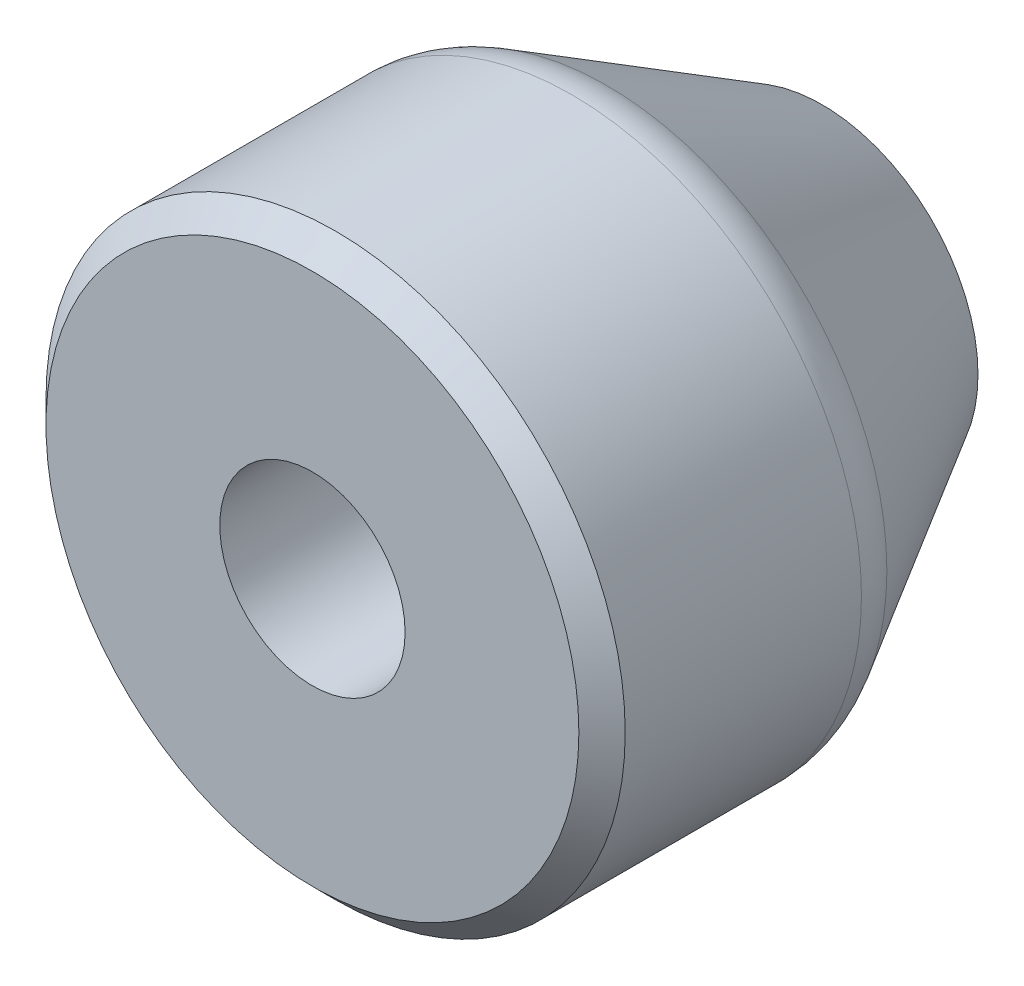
ISO-10303-21;
HEADER;
FILE_DESCRIPTION(('STEP AP214'),'2;1');
FILE_NAME('part.step','',(''),(''),'','','');
FILE_SCHEMA(('AUTOMOTIVE_DESIGN { 1 0 10303 214 1 1 1 1 }'));
ENDSEC;
DATA;
#1=APPLICATION_CONTEXT('core data for automotive mechanical design processes');
#2=APPLICATION_PROTOCOL_DEFINITION('international standard','automotive_design',2000,#1);
#3=PRODUCT_CONTEXT('',#1,'mechanical');
#4=PRODUCT('Part','Part','',(#3));
#5=PRODUCT_RELATED_PRODUCT_CATEGORY('part','',(#4));
#6=PRODUCT_DEFINITION_FORMATION('','',#4);
#7=PRODUCT_DEFINITION_CONTEXT('part definition',#1,'design');
#8=PRODUCT_DEFINITION('design','',#6,#7);
#9=PRODUCT_DEFINITION_SHAPE('','',#8);
#10=(LENGTH_UNIT() NAMED_UNIT(*) SI_UNIT(.MILLI.,.METRE.));
#11=(NAMED_UNIT(*) PLANE_ANGLE_UNIT() SI_UNIT($,.RADIAN.));
#12=(NAMED_UNIT(*) SI_UNIT($,.STERADIAN.) SOLID_ANGLE_UNIT());
#13=UNCERTAINTY_MEASURE_WITH_UNIT(LENGTH_MEASURE(1.E-05),#10,'distance_accuracy_value','');
#14=(GEOMETRIC_REPRESENTATION_CONTEXT(3) GLOBAL_UNCERTAINTY_ASSIGNED_CONTEXT((#13)) GLOBAL_UNIT_ASSIGNED_CONTEXT((#10,
#11,#12)) REPRESENTATION_CONTEXT('',''));
#15=CARTESIAN_POINT('',(0.,0.,0.));
#16=DIRECTION('',(0.,0.,1.));
#17=DIRECTION('',(1.,0.,0.));
#18=AXIS2_PLACEMENT_3D('',#15,#16,#17);
#19=CARTESIAN_POINT('',(0.,0.,26.));
#20=DIRECTION('',(0.,0.,1.));
#21=DIRECTION('',(1.,0.,0.));
#22=AXIS2_PLACEMENT_3D('',#19,#20,#21);
#23=CYLINDRICAL_SURFACE('',#22,12.5);
#24=CARTESIAN_POINT('',(0.,0.,21.));
#25=DIRECTION('',(0.,0.,1.));
#26=DIRECTION('',(1.,0.,0.));
#27=AXIS2_PLACEMENT_3D('',#24,#25,#26);
#28=CIRCLE('',#27,12.5);
#29=CARTESIAN_POINT('',(12.5,0.,21.));
#30=VERTEX_POINT('',#29);
#31=EDGE_CURVE('E37',#30,#30,#28,.T.);
#32=ORIENTED_EDGE('',*,*,#31,.F.);
#33=EDGE_LOOP('',(#32));
#34=FACE_BOUND('',#33,.T.);
#35=CARTESIAN_POINT('',(0.,0.,10.8038475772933));
#36=DIRECTION('',(0.,0.,1.));
#37=DIRECTION('',(1.,0.,0.));
#38=AXIS2_PLACEMENT_3D('',#35,#36,#37);
#39=CIRCLE('',#38,12.5);
#40=CARTESIAN_POINT('',(12.5,0.,10.8038475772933));
#41=VERTEX_POINT('',#40);
#42=EDGE_CURVE('E8',#41,#41,#39,.T.);
#43=ORIENTED_EDGE('',*,*,#42,.T.);
#44=EDGE_LOOP('',(#43));
#45=FACE_BOUND('',#44,.T.);
#46=ADVANCED_FACE('F12',(#34,#45),#23,.T.);
#47=CARTESIAN_POINT('',(0.,0.,10.8038475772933));
#48=DIRECTION('',(0.,0.,1.));
#49=DIRECTION('',(1.,0.,0.));
#50=AXIS2_PLACEMENT_3D('',#47,#48,#49);
#51=TOROIDAL_SURFACE('',#50,9.5,3.);
#52=CARTESIAN_POINT('',(0.,0.,9.3038475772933));
#53=DIRECTION('',(0.,0.,1.));
#54=DIRECTION('',(1.,0.,0.));
#55=AXIS2_PLACEMENT_3D('',#52,#53,#54);
#56=CIRCLE('',#55,12.0980762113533);
#57=CARTESIAN_POINT('',(12.0980762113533,0.,9.3038475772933));
#58=VERTEX_POINT('',#57);
#59=EDGE_CURVE('E18',#58,#58,#56,.T.);
#60=ORIENTED_EDGE('',*,*,#59,.T.);
#61=EDGE_LOOP('',(#60));
#62=FACE_BOUND('',#61,.T.);
#63=ORIENTED_EDGE('',*,*,#42,.F.);
#64=EDGE_LOOP('',(#63));
#65=FACE_BOUND('',#64,.T.);
#66=ADVANCED_FACE('F44',(#62,#65),#51,.T.);
#67=CARTESIAN_POINT('',(0.,0.,9.3038475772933));
#68=DIRECTION('',(0.,0.,1.));
#69=DIRECTION('',(1.,0.,0.));
#70=AXIS2_PLACEMENT_3D('',#67,#68,#69);
#71=CONICAL_SURFACE('',#70,12.0980762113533,0.523598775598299);
#72=CARTESIAN_POINT('',(0.,0.,0.));
#73=DIRECTION('',(0.,0.,1.));
#74=DIRECTION('',(1.,0.,0.));
#75=AXIS2_PLACEMENT_3D('',#72,#73,#74);
#76=CIRCLE('',#75,6.72649730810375);
#77=CARTESIAN_POINT('',(6.72649730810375,0.,0.));
#78=VERTEX_POINT('',#77);
#79=EDGE_CURVE('E22',#78,#78,#76,.T.);
#80=ORIENTED_EDGE('',*,*,#79,.T.);
#81=EDGE_LOOP('',(#80));
#82=FACE_BOUND('',#81,.T.);
#83=ORIENTED_EDGE('',*,*,#59,.F.);
#84=EDGE_LOOP('',(#83));
#85=FACE_BOUND('',#84,.T.);
#86=ADVANCED_FACE('F50',(#82,#85),#71,.T.);
#87=CARTESIAN_POINT('',(0.,-4.,0.));
#88=DIRECTION('',(0.,0.,1.));
#89=DIRECTION('',(1.,0.,0.));
#90=AXIS2_PLACEMENT_3D('',#87,#88,#89);
#91=PLANE('',#90);
#92=ORIENTED_EDGE('',*,*,#79,.F.);
#93=EDGE_LOOP('',(#92));
#94=FACE_BOUND('',#93,.T.);
#95=CARTESIAN_POINT('',(0.,0.,0.));
#96=DIRECTION('',(0.,0.,1.));
#97=DIRECTION('',(1.,0.,0.));
#98=AXIS2_PLACEMENT_3D('',#95,#96,#97);
#99=CIRCLE('',#98,4.);
#100=CARTESIAN_POINT('',(4.,0.,0.));
#101=VERTEX_POINT('',#100);
#102=EDGE_CURVE('E26',#101,#101,#99,.T.);
#103=ORIENTED_EDGE('',*,*,#102,.T.);
#104=EDGE_LOOP('',(#103));
#105=FACE_BOUND('',#104,.T.);
#106=ADVANCED_FACE('F55',(#94,#105),#91,.F.);
#107=CARTESIAN_POINT('',(0.,0.,26.));
#108=DIRECTION('',(0.,0.,1.));
#109=DIRECTION('',(1.,0.,0.));
#110=AXIS2_PLACEMENT_3D('',#107,#108,#109);
#111=CYLINDRICAL_SURFACE('',#110,4.);
#112=ORIENTED_EDGE('',*,*,#102,.F.);
#113=EDGE_LOOP('',(#112));
#114=FACE_BOUND('',#113,.T.);
#115=CARTESIAN_POINT('',(0.,0.,22.));
#116=DIRECTION('',(0.,0.,1.));
#117=DIRECTION('',(1.,0.,0.));
#118=AXIS2_PLACEMENT_3D('',#115,#116,#117);
#119=CIRCLE('',#118,4.);
#120=CARTESIAN_POINT('',(4.,0.,22.));
#121=VERTEX_POINT('',#120);
#122=EDGE_CURVE('E31',#121,#121,#119,.T.);
#123=ORIENTED_EDGE('',*,*,#122,.T.);
#124=EDGE_LOOP('',(#123));
#125=FACE_BOUND('',#124,.T.);
#126=ADVANCED_FACE('F62',(#114,#125),#111,.F.);
#127=CARTESIAN_POINT('',(0.,-4.,22.));
#128=DIRECTION('',(0.,0.,1.));
#129=DIRECTION('',(1.,0.,0.));
#130=AXIS2_PLACEMENT_3D('',#127,#128,#129);
#131=PLANE('',#130);
#132=CARTESIAN_POINT('',(0.,0.,22.));
#133=DIRECTION('',(0.,0.,1.));
#134=DIRECTION('',(1.,0.,0.));
#135=AXIS2_PLACEMENT_3D('',#132,#133,#134);
#136=CIRCLE('',#135,11.5);
#137=CARTESIAN_POINT('',(11.5,0.,22.));
#138=VERTEX_POINT('',#137);
#139=EDGE_CURVE('E34',#138,#138,#136,.T.);
#140=ORIENTED_EDGE('',*,*,#139,.T.);
#141=EDGE_LOOP('',(#140));
#142=FACE_BOUND('',#141,.T.);
#143=ORIENTED_EDGE('',*,*,#122,.F.);
#144=EDGE_LOOP('',(#143));
#145=FACE_BOUND('',#144,.T.);
#146=ADVANCED_FACE('F66',(#142,#145),#131,.T.);
#147=CARTESIAN_POINT('',(0.,0.,21.));
#148=DIRECTION('',(0.,0.,-1.));
#149=DIRECTION('',(-1.,0.,0.));
#150=AXIS2_PLACEMENT_3D('',#147,#148,#149);
#151=CONICAL_SURFACE('',#150,12.5,0.785398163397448);
#152=ORIENTED_EDGE('',*,*,#139,.F.);
#153=EDGE_LOOP('',(#152));
#154=FACE_BOUND('',#153,.T.);
#155=ORIENTED_EDGE('',*,*,#31,.T.);
#156=EDGE_LOOP('',(#155));
#157=FACE_BOUND('',#156,.T.);
#158=ADVANCED_FACE('F41',(#154,#157),#151,.T.);
#159=CLOSED_SHELL('',(#46,#66,#86,#106,#126,#146,#158));
#160=MANIFOLD_SOLID_BREP('B1',#159);
#161=ADVANCED_BREP_SHAPE_REPRESENTATION('',(#18,#160),#14);
#162=SHAPE_DEFINITION_REPRESENTATION(#9,#161);
ENDSEC;
END-ISO-10303-21;
